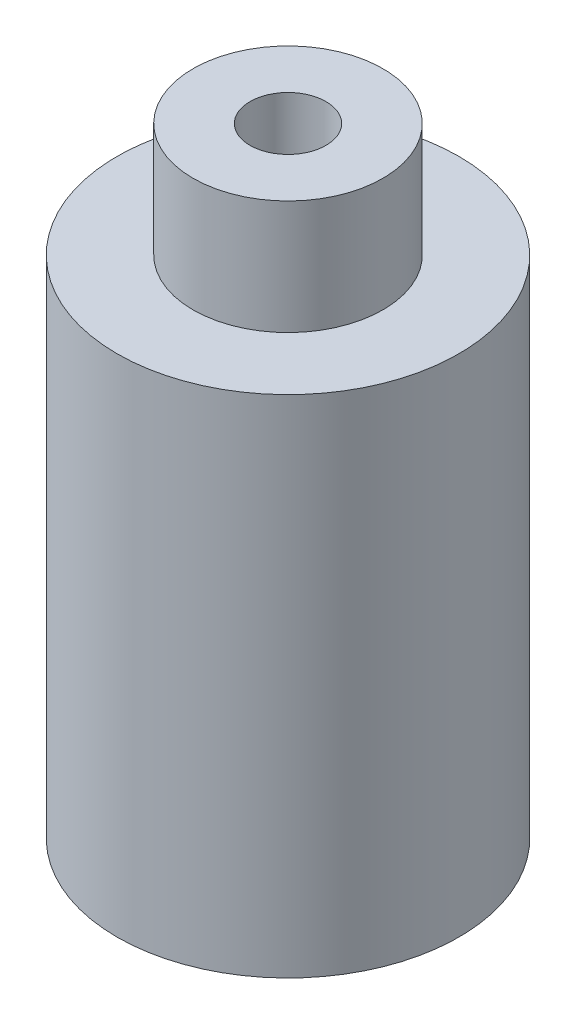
ISO-10303-21;
HEADER;
FILE_DESCRIPTION(('STEP AP214'),'2;1');
FILE_NAME('part.step','',(''),(''),'','','');
FILE_SCHEMA(('AUTOMOTIVE_DESIGN { 1 0 10303 214 1 1 1 1 }'));
ENDSEC;
DATA;
#1=APPLICATION_CONTEXT('core data for automotive mechanical design processes');
#2=APPLICATION_PROTOCOL_DEFINITION('international standard','automotive_design',2000,#1);
#3=PRODUCT_CONTEXT('',#1,'mechanical');
#4=PRODUCT('Part','Part','',(#3));
#5=PRODUCT_RELATED_PRODUCT_CATEGORY('part','',(#4));
#6=PRODUCT_DEFINITION_FORMATION('','',#4);
#7=PRODUCT_DEFINITION_CONTEXT('part definition',#1,'design');
#8=PRODUCT_DEFINITION('design','',#6,#7);
#9=PRODUCT_DEFINITION_SHAPE('','',#8);
#10=(LENGTH_UNIT() NAMED_UNIT(*) SI_UNIT(.MILLI.,.METRE.));
#11=(NAMED_UNIT(*) PLANE_ANGLE_UNIT() SI_UNIT($,.RADIAN.));
#12=(NAMED_UNIT(*) SI_UNIT($,.STERADIAN.) SOLID_ANGLE_UNIT());
#13=UNCERTAINTY_MEASURE_WITH_UNIT(LENGTH_MEASURE(1.E-05),#10,'distance_accuracy_value','');
#14=(GEOMETRIC_REPRESENTATION_CONTEXT(3) GLOBAL_UNCERTAINTY_ASSIGNED_CONTEXT((#13)) GLOBAL_UNIT_ASSIGNED_CONTEXT((#10,
#11,#12)) REPRESENTATION_CONTEXT('',''));
#15=CARTESIAN_POINT('',(0.,0.,0.));
#16=DIRECTION('',(0.,0.,1.));
#17=DIRECTION('',(1.,0.,0.));
#18=AXIS2_PLACEMENT_3D('',#15,#16,#17);
#19=CARTESIAN_POINT('',(-18.,-36.7,0.));
#20=DIRECTION('',(0.,1.,0.));
#21=DIRECTION('',(0.,0.,1.));
#22=AXIS2_PLACEMENT_3D('',#19,#20,#21);
#23=CYLINDRICAL_SURFACE('',#22,1.);
#24=DIRECTION('',(0.,1.,0.));
#25=VECTOR('',#24,1.);
#26=CARTESIAN_POINT('',(-18.,-36.7,1.));
#27=LINE('',#26,#25);
#28=CARTESIAN_POINT('',(-18.,-24.,1.));
#29=VERTEX_POINT('',#28);
#30=CARTESIAN_POINT('',(-18.,-19.5,1.));
#31=VERTEX_POINT('',#30);
#32=EDGE_CURVE('E10',#29,#31,#27,.T.);
#33=ORIENTED_EDGE('',*,*,#32,.F.);
#34=CARTESIAN_POINT('',(-18.,-24.,0.));
#35=DIRECTION('',(0.,1.,0.));
#36=DIRECTION('',(0.,0.,1.));
#37=AXIS2_PLACEMENT_3D('',#34,#35,#36);
#38=CIRCLE('',#37,1.);
#39=EDGE_CURVE('E19',#29,#29,#38,.T.);
#40=ORIENTED_EDGE('',*,*,#39,.F.);
#41=ORIENTED_EDGE('',*,*,#32,.T.);
#42=CARTESIAN_POINT('',(-18.,-19.5,0.));
#43=DIRECTION('',(0.,1.,0.));
#44=DIRECTION('',(0.,0.,1.));
#45=AXIS2_PLACEMENT_3D('',#42,#43,#44);
#46=CIRCLE('',#45,1.);
#47=EDGE_CURVE('E99',#31,#31,#46,.T.);
#48=ORIENTED_EDGE('',*,*,#47,.T.);
#49=EDGE_LOOP('',(#33,#40,#41,#48));
#50=FACE_BOUND('',#49,.T.);
#51=ADVANCED_FACE('F15',(#50),#23,.F.);
#52=CARTESIAN_POINT('',(-18.,-24.,0.));
#53=DIRECTION('',(0.,1.,0.));
#54=DIRECTION('',(1.,0.,0.));
#55=AXIS2_PLACEMENT_3D('',#52,#53,#54);
#56=PLANE('',#55);
#57=ORIENTED_EDGE('',*,*,#39,.T.);
#58=EDGE_LOOP('',(#57));
#59=FACE_BOUND('',#58,.T.);
#60=CARTESIAN_POINT('',(-18.,-24.,0.));
#61=DIRECTION('',(0.,1.,0.));
#62=DIRECTION('',(0.,0.,1.));
#63=AXIS2_PLACEMENT_3D('',#60,#61,#62);
#64=CIRCLE('',#63,2.);
#65=CARTESIAN_POINT('',(-18.,-24.,2.));
#66=VERTEX_POINT('',#65);
#67=EDGE_CURVE('E95',#66,#66,#64,.T.);
#68=ORIENTED_EDGE('',*,*,#67,.F.);
#69=EDGE_LOOP('',(#68));
#70=FACE_BOUND('',#69,.T.);
#71=ADVANCED_FACE('F119',(#59,#70),#56,.F.);
#72=CARTESIAN_POINT('',(-18.,-19.5,0.));
#73=DIRECTION('',(0.,1.,0.));
#74=DIRECTION('',(1.,0.,0.));
#75=AXIS2_PLACEMENT_3D('',#72,#73,#74);
#76=PLANE('',#75);
#77=ORIENTED_EDGE('',*,*,#47,.F.);
#78=EDGE_LOOP('',(#77));
#79=FACE_BOUND('',#78,.T.);
#80=CARTESIAN_POINT('',(-18.,-19.5,0.));
#81=DIRECTION('',(0.,1.,0.));
#82=DIRECTION('',(0.,0.,1.));
#83=AXIS2_PLACEMENT_3D('',#80,#81,#82);
#84=CIRCLE('',#83,2.5);
#85=CARTESIAN_POINT('',(-18.,-19.5,2.5));
#86=VERTEX_POINT('',#85);
#87=EDGE_CURVE('E76',#86,#86,#84,.T.);
#88=ORIENTED_EDGE('',*,*,#87,.T.);
#89=EDGE_LOOP('',(#88));
#90=FACE_BOUND('',#89,.T.);
#91=ADVANCED_FACE('F83',(#79,#90),#76,.T.);
#92=CARTESIAN_POINT('',(-18.,-36.7,0.));
#93=DIRECTION('',(0.,1.,0.));
#94=DIRECTION('',(0.,0.,1.));
#95=AXIS2_PLACEMENT_3D('',#92,#93,#94);
#96=CYLINDRICAL_SURFACE('',#95,2.);
#97=CARTESIAN_POINT('',(-18.,-35.8,0.));
#98=DIRECTION('',(0.,1.,0.));
#99=DIRECTION('',(0.,0.,1.));
#100=AXIS2_PLACEMENT_3D('',#97,#98,#99);
#101=CIRCLE('',#100,2.);
#102=CARTESIAN_POINT('',(-18.,-35.8,2.));
#103=VERTEX_POINT('',#102);
#104=EDGE_CURVE('E85',#103,#103,#101,.T.);
#105=ORIENTED_EDGE('',*,*,#104,.F.);
#106=DIRECTION('',(0.,1.,0.));
#107=VECTOR('',#106,1.);
#108=CARTESIAN_POINT('',(-18.,-36.7,2.));
#109=LINE('',#108,#107);
#110=EDGE_CURVE('E80',#103,#66,#109,.T.);
#111=ORIENTED_EDGE('',*,*,#110,.T.);
#112=ORIENTED_EDGE('',*,*,#67,.T.);
#113=ORIENTED_EDGE('',*,*,#110,.F.);
#114=EDGE_LOOP('',(#105,#111,#112,#113));
#115=FACE_BOUND('',#114,.T.);
#116=ADVANCED_FACE('F129',(#115),#96,.F.);
#117=CARTESIAN_POINT('',(-18.,-22.5,0.));
#118=DIRECTION('',(0.,1.,0.));
#119=DIRECTION('',(0.,0.,1.));
#120=AXIS2_PLACEMENT_3D('',#117,#118,#119);
#121=CYLINDRICAL_SURFACE('',#120,2.5);
#122=ORIENTED_EDGE('',*,*,#87,.F.);
#123=DIRECTION('',(0.,1.,0.));
#124=VECTOR('',#123,1.);
#125=CARTESIAN_POINT('',(-18.,-22.5,2.5));
#126=LINE('',#125,#124);
#127=CARTESIAN_POINT('',(-18.,-22.5,2.5));
#128=VERTEX_POINT('',#127);
#129=EDGE_CURVE('E59',#128,#86,#126,.T.);
#130=ORIENTED_EDGE('',*,*,#129,.F.);
#131=CARTESIAN_POINT('',(-18.,-22.5,0.));
#132=DIRECTION('',(0.,1.,0.));
#133=DIRECTION('',(0.,0.,1.));
#134=AXIS2_PLACEMENT_3D('',#131,#132,#133);
#135=CIRCLE('',#134,2.5);
#136=EDGE_CURVE('E78',#128,#128,#135,.T.);
#137=ORIENTED_EDGE('',*,*,#136,.T.);
#138=ORIENTED_EDGE('',*,*,#129,.T.);
#139=EDGE_LOOP('',(#122,#130,#137,#138));
#140=FACE_BOUND('',#139,.T.);
#141=ADVANCED_FACE('F75',(#140),#121,.T.);
#142=CARTESIAN_POINT('',(-18.,-35.8,0.));
#143=DIRECTION('',(0.,1.,0.));
#144=DIRECTION('',(1.,0.,0.));
#145=AXIS2_PLACEMENT_3D('',#142,#143,#144);
#146=PLANE('',#145);
#147=ORIENTED_EDGE('',*,*,#104,.T.);
#148=EDGE_LOOP('',(#147));
#149=FACE_BOUND('',#148,.T.);
#150=CARTESIAN_POINT('',(-18.,-35.8,0.));
#151=DIRECTION('',(0.,1.,0.));
#152=DIRECTION('',(0.,0.,1.));
#153=AXIS2_PLACEMENT_3D('',#150,#151,#152);
#154=CIRCLE('',#153,4.5);
#155=CARTESIAN_POINT('',(-18.,-35.8,4.5));
#156=VERTEX_POINT('',#155);
#157=EDGE_CURVE('E70',#156,#156,#154,.T.);
#158=ORIENTED_EDGE('',*,*,#157,.F.);
#159=EDGE_LOOP('',(#158));
#160=FACE_BOUND('',#159,.T.);
#161=ADVANCED_FACE('F140',(#149,#160),#146,.F.);
#162=CARTESIAN_POINT('',(-18.,-22.5,0.));
#163=DIRECTION('',(0.,1.,0.));
#164=DIRECTION('',(1.,0.,0.));
#165=AXIS2_PLACEMENT_3D('',#162,#163,#164);
#166=PLANE('',#165);
#167=ORIENTED_EDGE('',*,*,#136,.F.);
#168=EDGE_LOOP('',(#167));
#169=FACE_BOUND('',#168,.T.);
#170=CARTESIAN_POINT('',(-18.,-22.5,0.));
#171=DIRECTION('',(0.,1.,0.));
#172=DIRECTION('',(0.,0.,1.));
#173=AXIS2_PLACEMENT_3D('',#170,#171,#172);
#174=CIRCLE('',#173,4.5);
#175=CARTESIAN_POINT('',(-18.,-22.5,4.5));
#176=VERTEX_POINT('',#175);
#177=EDGE_CURVE('E100',#176,#176,#174,.T.);
#178=ORIENTED_EDGE('',*,*,#177,.T.);
#179=EDGE_LOOP('',(#178));
#180=FACE_BOUND('',#179,.T.);
#181=ADVANCED_FACE('F17',(#169,#180),#166,.T.);
#182=CARTESIAN_POINT('',(-18.,-35.8,0.));
#183=DIRECTION('',(0.,1.,0.));
#184=DIRECTION('',(0.,0.,1.));
#185=AXIS2_PLACEMENT_3D('',#182,#183,#184);
#186=CYLINDRICAL_SURFACE('',#185,4.5);
#187=ORIENTED_EDGE('',*,*,#177,.F.);
#188=DIRECTION('',(0.,1.,0.));
#189=VECTOR('',#188,1.);
#190=CARTESIAN_POINT('',(-18.,-35.8,4.5));
#191=LINE('',#190,#189);
#192=EDGE_CURVE('E103',#156,#176,#191,.T.);
#193=ORIENTED_EDGE('',*,*,#192,.F.);
#194=ORIENTED_EDGE('',*,*,#157,.T.);
#195=ORIENTED_EDGE('',*,*,#192,.T.);
#196=EDGE_LOOP('',(#187,#193,#194,#195));
#197=FACE_BOUND('',#196,.T.);
#198=ADVANCED_FACE('F135',(#197),#186,.T.);
#199=CLOSED_SHELL('',(#51,#71,#91,#116,#141,#161,#181,#198));
#200=MANIFOLD_SOLID_BREP('B1',#199);
#201=ADVANCED_BREP_SHAPE_REPRESENTATION('',(#18,#200),#14);
#202=SHAPE_DEFINITION_REPRESENTATION(#9,#201);
ENDSEC;
END-ISO-10303-21;
